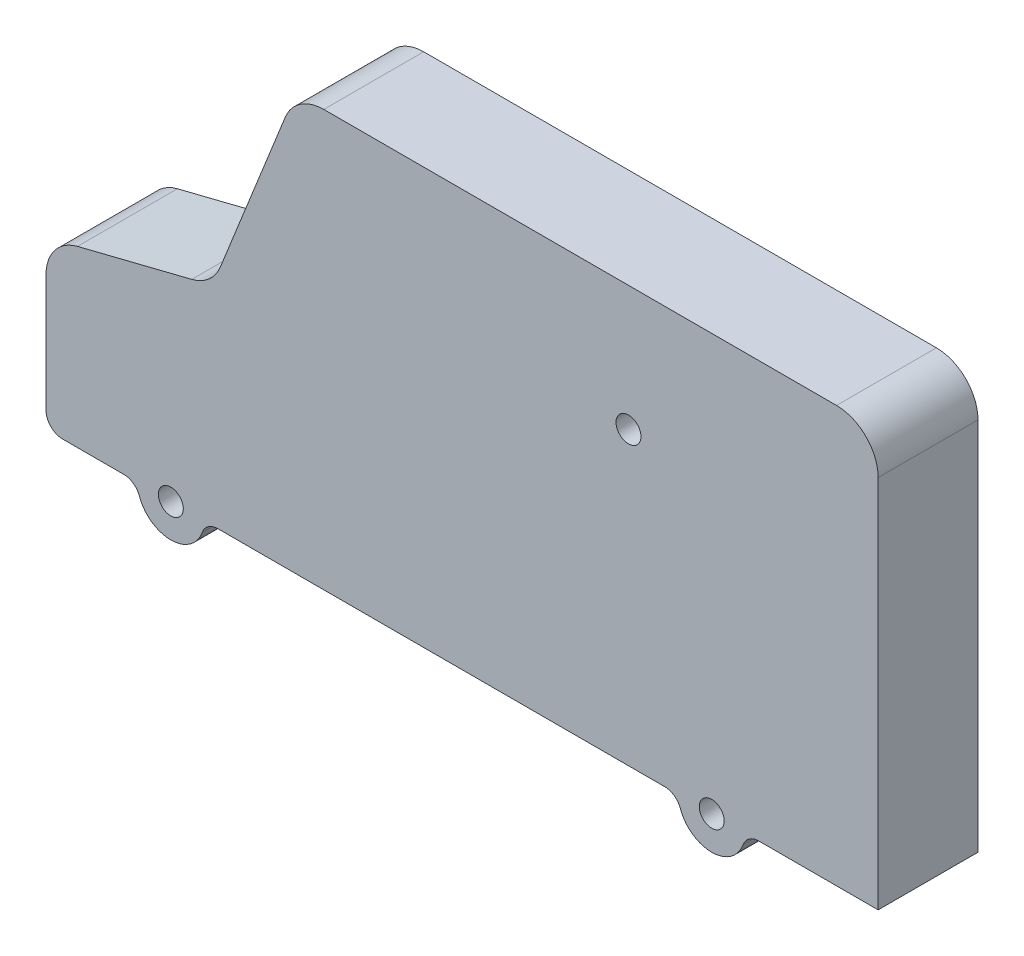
from build123d import *

# Parameters (mm, degrees)
ESQUISSE1_R      = 1.5
EXTRUSION1_DEPTH = 12


with BuildPart() as part:
    # Esquisse1 → Extrusion1 (new body)
    with BuildSketch(Plane.XY):
        with BuildLine():
            Line((3.787321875, 20.946830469), (17.519775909, 24.379943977))
            ThreePointArc((17.519775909, 24.379943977), (19.595119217, 25.463838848), (20.949481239, 27.373703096))
            Line((20.949481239, 27.373703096), (28.742781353, 46.856953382))
            ThreePointArc((28.742781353, 46.856953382), (30.582020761, 49.140336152), (33.385164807, 50))
            Line((33.385164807, 50), (95, 50))
            ThreePointArc((95, 50), (98.535533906, 48.535533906), (100, 45))
            Line((100, 45), (100, 0))
            Line((100, 0), (85.656854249, 0))
            ThreePointArc((85.656854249, 0), (84.502153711, -0.367006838), (83.771236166, -1.333333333))
            ThreePointArc((83.771236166, -1.333333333), (80, -4), (76.228763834, -1.333333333))
            ThreePointArc((76.228763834, -1.333333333), (75.497846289, -0.367006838), (74.343145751, 0))
            Line((74.343145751, 0), (20.656854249, 0))
            ThreePointArc((20.656854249, 0), (19.502153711, -0.367006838), (18.771236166, -1.333333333))
            ThreePointArc((18.771236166, -1.333333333), (15, -4), (11.228763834, -1.333333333))
            ThreePointArc((11.228763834, -1.333333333), (10.497846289, -0.367006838), (9.343145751, 0))
            Line((9.343145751, 0), (2, 0))
            ThreePointArc((2, 0), (0.585786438, 0.585786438), (0, 2))
            Line((0, 2), (0, 16.096117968))
            ThreePointArc((0, 16.096117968), (1.05897281, 19.173179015), (3.787321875, 20.946830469))
        make_face()
        with Locations((15, 0)):
            Circle(ESQUISSE1_R, mode=Mode.SUBTRACT)
        with Locations((80, 0)):
            Circle(ESQUISSE1_R, mode=Mode.SUBTRACT)
        with Locations((70, 35)):
            Circle(ESQUISSE1_R, mode=Mode.SUBTRACT)
    extrude(amount=EXTRUSION1_DEPTH)


solid = part.part
